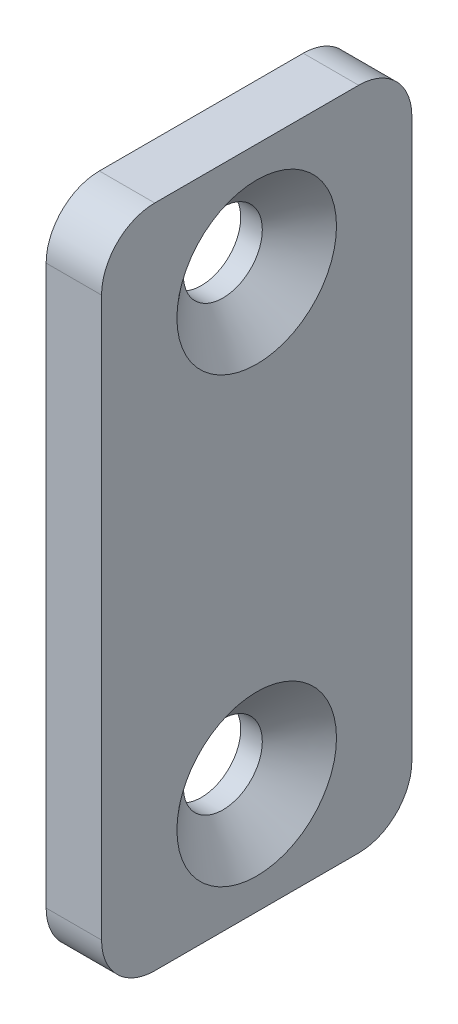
ISO-10303-21;
HEADER;
FILE_DESCRIPTION(('STEP AP214'),'2;1');
FILE_NAME('part.step','',(''),(''),'','','');
FILE_SCHEMA(('AUTOMOTIVE_DESIGN { 1 0 10303 214 1 1 1 1 }'));
ENDSEC;
DATA;
#1=APPLICATION_CONTEXT('core data for automotive mechanical design processes');
#2=APPLICATION_PROTOCOL_DEFINITION('international standard','automotive_design',2000,#1);
#3=PRODUCT_CONTEXT('',#1,'mechanical');
#4=PRODUCT('Part','Part','',(#3));
#5=PRODUCT_RELATED_PRODUCT_CATEGORY('part','',(#4));
#6=PRODUCT_DEFINITION_FORMATION('','',#4);
#7=PRODUCT_DEFINITION_CONTEXT('part definition',#1,'design');
#8=PRODUCT_DEFINITION('design','',#6,#7);
#9=PRODUCT_DEFINITION_SHAPE('','',#8);
#10=(LENGTH_UNIT() NAMED_UNIT(*) SI_UNIT(.MILLI.,.METRE.));
#11=(NAMED_UNIT(*) PLANE_ANGLE_UNIT() SI_UNIT($,.RADIAN.));
#12=(NAMED_UNIT(*) SI_UNIT($,.STERADIAN.) SOLID_ANGLE_UNIT());
#13=UNCERTAINTY_MEASURE_WITH_UNIT(LENGTH_MEASURE(1.E-05),#10,'distance_accuracy_value','');
#14=(GEOMETRIC_REPRESENTATION_CONTEXT(3) GLOBAL_UNCERTAINTY_ASSIGNED_CONTEXT((#13)) GLOBAL_UNIT_ASSIGNED_CONTEXT((#10,
#11,#12)) REPRESENTATION_CONTEXT('',''));
#15=CARTESIAN_POINT('',(0.,0.,0.));
#16=DIRECTION('',(0.,0.,1.));
#17=DIRECTION('',(1.,0.,0.));
#18=AXIS2_PLACEMENT_3D('',#15,#16,#17);
#19=CARTESIAN_POINT('',(1.5875,0.,0.));
#20=DIRECTION('',(1.,0.,0.));
#21=DIRECTION('',(0.,0.,-1.));
#22=AXIS2_PLACEMENT_3D('',#19,#20,#21);
#23=PLANE('',#22);
#24=CARTESIAN_POINT('',(1.587499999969,6.35,0.));
#25=DIRECTION('',(1.,0.,0.));
#26=DIRECTION('',(0.,0.,-1.));
#27=AXIS2_PLACEMENT_3D('',#24,#25,#26);
#28=CIRCLE('',#27,2.28600000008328);
#29=CARTESIAN_POINT('',(1.587499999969,6.35,-2.28600000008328));
#30=VERTEX_POINT('',#29);
#31=EDGE_CURVE('E98',#30,#30,#28,.F.);
#32=ORIENTED_EDGE('',*,*,#31,.T.);
#33=EDGE_LOOP('',(#32));
#34=FACE_BOUND('',#33,.T.);
#35=CARTESIAN_POINT('',(1.58749999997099,-6.35,0.));
#36=DIRECTION('',(1.,0.,0.));
#37=DIRECTION('',(0.,0.,-1.));
#38=AXIS2_PLACEMENT_3D('',#35,#36,#37);
#39=CIRCLE('',#38,2.28600000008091);
#40=CARTESIAN_POINT('',(1.58749999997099,-6.35,-2.28600000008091));
#41=VERTEX_POINT('',#40);
#42=EDGE_CURVE('E20',#41,#41,#39,.F.);
#43=ORIENTED_EDGE('',*,*,#42,.T.);
#44=EDGE_LOOP('',(#43));
#45=FACE_BOUND('',#44,.T.);
#46=DIRECTION('',(0.,1.,0.));
#47=VECTOR('',#46,1.);
#48=CARTESIAN_POINT('',(1.5875,8.001,4.445));
#49=LINE('',#48,#47);
#50=CARTESIAN_POINT('',(1.5875,-8.001,4.445));
#51=VERTEX_POINT('',#50);
#52=CARTESIAN_POINT('',(1.5875,8.001,4.445));
#53=VERTEX_POINT('',#52);
#54=EDGE_CURVE('E94',#51,#53,#49,.T.);
#55=ORIENTED_EDGE('',*,*,#54,.F.);
#56=CARTESIAN_POINT('',(1.5875,-8.001,2.921));
#57=DIRECTION('',(1.,0.,0.));
#58=DIRECTION('',(0.,0.,-1.));
#59=AXIS2_PLACEMENT_3D('',#56,#57,#58);
#60=CIRCLE('',#59,1.524);
#61=CARTESIAN_POINT('',(1.5875,-9.525,2.921));
#62=VERTEX_POINT('',#61);
#63=EDGE_CURVE('E89',#62,#51,#60,.F.);
#64=ORIENTED_EDGE('',*,*,#63,.F.);
#65=DIRECTION('',(0.,0.,-1.));
#66=VECTOR('',#65,1.);
#67=CARTESIAN_POINT('',(1.5875,-9.525,2.921));
#68=LINE('',#67,#66);
#69=CARTESIAN_POINT('',(1.5875,-9.525,-2.921));
#70=VERTEX_POINT('',#69);
#71=EDGE_CURVE('E79',#70,#62,#68,.F.);
#72=ORIENTED_EDGE('',*,*,#71,.F.);
#73=CARTESIAN_POINT('',(1.5875,-8.001,-2.921));
#74=DIRECTION('',(1.,0.,0.));
#75=DIRECTION('',(0.,0.,-1.));
#76=AXIS2_PLACEMENT_3D('',#73,#74,#75);
#77=CIRCLE('',#76,1.524);
#78=CARTESIAN_POINT('',(1.5875,-8.001,-4.445));
#79=VERTEX_POINT('',#78);
#80=EDGE_CURVE('E103',#79,#70,#77,.F.);
#81=ORIENTED_EDGE('',*,*,#80,.F.);
#82=DIRECTION('',(0.,1.,0.));
#83=VECTOR('',#82,1.);
#84=CARTESIAN_POINT('',(1.5875,-8.001,-4.445));
#85=LINE('',#84,#83);
#86=CARTESIAN_POINT('',(1.5875,8.001,-4.445));
#87=VERTEX_POINT('',#86);
#88=EDGE_CURVE('E121',#87,#79,#85,.F.);
#89=ORIENTED_EDGE('',*,*,#88,.F.);
#90=CARTESIAN_POINT('',(1.5875,8.001,-2.921));
#91=DIRECTION('',(1.,0.,0.));
#92=DIRECTION('',(0.,0.,-1.));
#93=AXIS2_PLACEMENT_3D('',#90,#91,#92);
#94=CIRCLE('',#93,1.524);
#95=CARTESIAN_POINT('',(1.5875,9.525,-2.921));
#96=VERTEX_POINT('',#95);
#97=EDGE_CURVE('E143',#96,#87,#94,.F.);
#98=ORIENTED_EDGE('',*,*,#97,.F.);
#99=DIRECTION('',(0.,0.,1.));
#100=VECTOR('',#99,1.);
#101=CARTESIAN_POINT('',(1.5875,9.525,-2.921));
#102=LINE('',#101,#100);
#103=CARTESIAN_POINT('',(1.5875,9.525,2.921));
#104=VERTEX_POINT('',#103);
#105=EDGE_CURVE('E117',#104,#96,#102,.F.);
#106=ORIENTED_EDGE('',*,*,#105,.F.);
#107=CARTESIAN_POINT('',(1.5875,8.001,2.921));
#108=DIRECTION('',(1.,0.,0.));
#109=DIRECTION('',(0.,0.,-1.));
#110=AXIS2_PLACEMENT_3D('',#107,#108,#109);
#111=CIRCLE('',#110,1.524);
#112=EDGE_CURVE('E140',#53,#104,#111,.F.);
#113=ORIENTED_EDGE('',*,*,#112,.F.);
#114=EDGE_LOOP('',(#55,#64,#72,#81,#89,#98,#106,#113));
#115=FACE_BOUND('',#114,.T.);
#116=ADVANCED_FACE('F17',(#34,#45,#115),#23,.T.);
#117=CARTESIAN_POINT('',(1.58749999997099,-6.35,0.));
#118=DIRECTION('',(1.,0.,0.));
#119=DIRECTION('',(0.,0.,-1.));
#120=AXIS2_PLACEMENT_3D('',#117,#118,#119);
#121=CONICAL_SURFACE('',#120,2.28600000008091,0.872664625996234);
#122=CARTESIAN_POINT('',(0.617752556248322,-6.35,0.));
#123=DIRECTION('',(1.,0.,0.));
#124=DIRECTION('',(0.,0.,-1.));
#125=AXIS2_PLACEMENT_3D('',#122,#123,#124);
#126=CIRCLE('',#125,1.1303);
#127=CARTESIAN_POINT('',(0.617752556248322,-6.35,-1.1303));
#128=VERTEX_POINT('',#127);
#129=EDGE_CURVE('E112',#128,#128,#126,.F.);
#130=ORIENTED_EDGE('',*,*,#129,.T.);
#131=EDGE_LOOP('',(#130));
#132=FACE_BOUND('',#131,.T.);
#133=ORIENTED_EDGE('',*,*,#42,.F.);
#134=EDGE_LOOP('',(#133));
#135=FACE_BOUND('',#134,.T.);
#136=ADVANCED_FACE('F151',(#132,#135),#121,.F.);
#137=CARTESIAN_POINT('',(1.58749999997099,6.35,0.));
#138=DIRECTION('',(1.,0.,0.));
#139=DIRECTION('',(0.,0.,-1.));
#140=AXIS2_PLACEMENT_3D('',#137,#138,#139);
#141=CONICAL_SURFACE('',#140,2.28600000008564,0.872664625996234);
#142=CARTESIAN_POINT('',(0.617752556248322,6.35,0.));
#143=DIRECTION('',(-1.,0.,0.));
#144=DIRECTION('',(0.,0.,1.));
#145=AXIS2_PLACEMENT_3D('',#142,#143,#144);
#146=CIRCLE('',#145,1.1303);
#147=CARTESIAN_POINT('',(0.617752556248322,6.35,1.1303));
#148=VERTEX_POINT('',#147);
#149=EDGE_CURVE('E109',#148,#148,#146,.T.);
#150=ORIENTED_EDGE('',*,*,#149,.T.);
#151=EDGE_LOOP('',(#150));
#152=FACE_BOUND('',#151,.T.);
#153=ORIENTED_EDGE('',*,*,#31,.F.);
#154=EDGE_LOOP('',(#153));
#155=FACE_BOUND('',#154,.T.);
#156=ADVANCED_FACE('F153',(#152,#155),#141,.F.);
#157=CARTESIAN_POINT('',(0.,-8.001,2.921));
#158=DIRECTION('',(1.,0.,0.));
#159=DIRECTION('',(0.,0.,-1.));
#160=AXIS2_PLACEMENT_3D('',#157,#158,#159);
#161=CYLINDRICAL_SURFACE('',#160,1.524);
#162=DIRECTION('',(1.,0.,0.));
#163=VECTOR('',#162,1.);
#164=CARTESIAN_POINT('',(0.,-8.001,4.445));
#165=LINE('',#164,#163);
#166=CARTESIAN_POINT('',(0.,-8.001,4.445));
#167=VERTEX_POINT('',#166);
#168=EDGE_CURVE('E116',#167,#51,#165,.T.);
#169=ORIENTED_EDGE('',*,*,#168,.F.);
#170=CARTESIAN_POINT('',(0.,-8.001,2.921));
#171=DIRECTION('',(1.,0.,0.));
#172=DIRECTION('',(0.,0.,-1.));
#173=AXIS2_PLACEMENT_3D('',#170,#171,#172);
#174=CIRCLE('',#173,1.524);
#175=CARTESIAN_POINT('',(0.,-9.525,2.921));
#176=VERTEX_POINT('',#175);
#177=EDGE_CURVE('E102',#167,#176,#174,.T.);
#178=ORIENTED_EDGE('',*,*,#177,.T.);
#179=DIRECTION('',(1.,0.,0.));
#180=VECTOR('',#179,1.);
#181=CARTESIAN_POINT('',(0.,-9.525,2.921));
#182=LINE('',#181,#180);
#183=EDGE_CURVE('E84',#62,#176,#182,.F.);
#184=ORIENTED_EDGE('',*,*,#183,.F.);
#185=ORIENTED_EDGE('',*,*,#63,.T.);
#186=EDGE_LOOP('',(#169,#178,#184,#185));
#187=FACE_BOUND('',#186,.T.);
#188=ADVANCED_FACE('F101',(#187),#161,.T.);
#189=CARTESIAN_POINT('',(0.,-9.525,2.921));
#190=DIRECTION('',(0.,-1.,0.));
#191=DIRECTION('',(0.,0.,-1.));
#192=AXIS2_PLACEMENT_3D('',#189,#190,#191);
#193=PLANE('',#192);
#194=ORIENTED_EDGE('',*,*,#183,.T.);
#195=DIRECTION('',(0.,0.,-1.));
#196=VECTOR('',#195,1.);
#197=CARTESIAN_POINT('',(0.,-9.525,0.));
#198=LINE('',#197,#196);
#199=CARTESIAN_POINT('',(0.,-9.525,-2.921));
#200=VERTEX_POINT('',#199);
#201=EDGE_CURVE('E138',#176,#200,#198,.T.);
#202=ORIENTED_EDGE('',*,*,#201,.T.);
#203=DIRECTION('',(1.,0.,0.));
#204=VECTOR('',#203,1.);
#205=CARTESIAN_POINT('',(0.,-9.525,-2.921));
#206=LINE('',#205,#204);
#207=EDGE_CURVE('E86',#70,#200,#206,.F.);
#208=ORIENTED_EDGE('',*,*,#207,.F.);
#209=ORIENTED_EDGE('',*,*,#71,.T.);
#210=EDGE_LOOP('',(#194,#202,#208,#209));
#211=FACE_BOUND('',#210,.T.);
#212=ADVANCED_FACE('F81',(#211),#193,.T.);
#213=CARTESIAN_POINT('',(0.,-8.001,-2.921));
#214=DIRECTION('',(1.,0.,0.));
#215=DIRECTION('',(0.,0.,-1.));
#216=AXIS2_PLACEMENT_3D('',#213,#214,#215);
#217=CYLINDRICAL_SURFACE('',#216,1.524);
#218=ORIENTED_EDGE('',*,*,#207,.T.);
#219=CARTESIAN_POINT('',(0.,-8.001,-2.921));
#220=DIRECTION('',(1.,0.,0.));
#221=DIRECTION('',(0.,0.,-1.));
#222=AXIS2_PLACEMENT_3D('',#219,#220,#221);
#223=CIRCLE('',#222,1.524);
#224=CARTESIAN_POINT('',(0.,-8.001,-4.445));
#225=VERTEX_POINT('',#224);
#226=EDGE_CURVE('E135',#200,#225,#223,.T.);
#227=ORIENTED_EDGE('',*,*,#226,.T.);
#228=DIRECTION('',(-1.,0.,0.));
#229=VECTOR('',#228,1.);
#230=CARTESIAN_POINT('',(0.,-8.001,-4.445));
#231=LINE('',#230,#229);
#232=EDGE_CURVE('E122',#79,#225,#231,.T.);
#233=ORIENTED_EDGE('',*,*,#232,.F.);
#234=ORIENTED_EDGE('',*,*,#80,.T.);
#235=EDGE_LOOP('',(#218,#227,#233,#234));
#236=FACE_BOUND('',#235,.T.);
#237=ADVANCED_FACE('F197',(#236),#217,.T.);
#238=CARTESIAN_POINT('',(0.,-8.001,-4.445));
#239=DIRECTION('',(0.,0.,-1.));
#240=DIRECTION('',(-1.,0.,0.));
#241=AXIS2_PLACEMENT_3D('',#238,#239,#240);
#242=PLANE('',#241);
#243=ORIENTED_EDGE('',*,*,#232,.T.);
#244=DIRECTION('',(0.,1.,0.));
#245=VECTOR('',#244,1.);
#246=CARTESIAN_POINT('',(0.,0.,-4.445));
#247=LINE('',#246,#245);
#248=CARTESIAN_POINT('',(0.,8.001,-4.445));
#249=VERTEX_POINT('',#248);
#250=EDGE_CURVE('E134',#225,#249,#247,.T.);
#251=ORIENTED_EDGE('',*,*,#250,.T.);
#252=DIRECTION('',(1.,0.,0.));
#253=VECTOR('',#252,1.);
#254=CARTESIAN_POINT('',(0.,8.001,-4.445));
#255=LINE('',#254,#253);
#256=EDGE_CURVE('E120',#87,#249,#255,.F.);
#257=ORIENTED_EDGE('',*,*,#256,.F.);
#258=ORIENTED_EDGE('',*,*,#88,.T.);
#259=EDGE_LOOP('',(#243,#251,#257,#258));
#260=FACE_BOUND('',#259,.T.);
#261=ADVANCED_FACE('F193',(#260),#242,.T.);
#262=CARTESIAN_POINT('',(0.,8.001,-2.921));
#263=DIRECTION('',(1.,0.,0.));
#264=DIRECTION('',(0.,0.,-1.));
#265=AXIS2_PLACEMENT_3D('',#262,#263,#264);
#266=CYLINDRICAL_SURFACE('',#265,1.524);
#267=ORIENTED_EDGE('',*,*,#256,.T.);
#268=CARTESIAN_POINT('',(0.,8.001,-2.921));
#269=DIRECTION('',(1.,0.,0.));
#270=DIRECTION('',(0.,0.,-1.));
#271=AXIS2_PLACEMENT_3D('',#268,#269,#270);
#272=CIRCLE('',#271,1.524);
#273=CARTESIAN_POINT('',(0.,9.525,-2.921));
#274=VERTEX_POINT('',#273);
#275=EDGE_CURVE('E131',#249,#274,#272,.T.);
#276=ORIENTED_EDGE('',*,*,#275,.T.);
#277=DIRECTION('',(1.,0.,0.));
#278=VECTOR('',#277,1.);
#279=CARTESIAN_POINT('',(0.,9.525,-2.921));
#280=LINE('',#279,#278);
#281=EDGE_CURVE('E119',#96,#274,#280,.F.);
#282=ORIENTED_EDGE('',*,*,#281,.F.);
#283=ORIENTED_EDGE('',*,*,#97,.T.);
#284=EDGE_LOOP('',(#267,#276,#282,#283));
#285=FACE_BOUND('',#284,.T.);
#286=ADVANCED_FACE('F189',(#285),#266,.T.);
#287=CARTESIAN_POINT('',(0.,9.525,-2.921));
#288=DIRECTION('',(0.,1.,0.));
#289=DIRECTION('',(0.,0.,1.));
#290=AXIS2_PLACEMENT_3D('',#287,#288,#289);
#291=PLANE('',#290);
#292=ORIENTED_EDGE('',*,*,#281,.T.);
#293=DIRECTION('',(0.,0.,-1.));
#294=VECTOR('',#293,1.);
#295=CARTESIAN_POINT('',(0.,9.525,0.));
#296=LINE('',#295,#294);
#297=CARTESIAN_POINT('',(0.,9.525,2.921));
#298=VERTEX_POINT('',#297);
#299=EDGE_CURVE('E130',#274,#298,#296,.F.);
#300=ORIENTED_EDGE('',*,*,#299,.T.);
#301=DIRECTION('',(1.,0.,0.));
#302=VECTOR('',#301,1.);
#303=CARTESIAN_POINT('',(0.,9.525,2.921));
#304=LINE('',#303,#302);
#305=EDGE_CURVE('E142',#104,#298,#304,.F.);
#306=ORIENTED_EDGE('',*,*,#305,.F.);
#307=ORIENTED_EDGE('',*,*,#105,.T.);
#308=EDGE_LOOP('',(#292,#300,#306,#307));
#309=FACE_BOUND('',#308,.T.);
#310=ADVANCED_FACE('F185',(#309),#291,.T.);
#311=CARTESIAN_POINT('',(0.,8.001,2.921));
#312=DIRECTION('',(1.,0.,0.));
#313=DIRECTION('',(0.,0.,-1.));
#314=AXIS2_PLACEMENT_3D('',#311,#312,#313);
#315=CYLINDRICAL_SURFACE('',#314,1.524);
#316=ORIENTED_EDGE('',*,*,#305,.T.);
#317=CARTESIAN_POINT('',(0.,8.001,2.921));
#318=DIRECTION('',(1.,0.,0.));
#319=DIRECTION('',(0.,0.,-1.));
#320=AXIS2_PLACEMENT_3D('',#317,#318,#319);
#321=CIRCLE('',#320,1.524);
#322=CARTESIAN_POINT('',(0.,8.001,4.445));
#323=VERTEX_POINT('',#322);
#324=EDGE_CURVE('E127',#298,#323,#321,.T.);
#325=ORIENTED_EDGE('',*,*,#324,.T.);
#326=DIRECTION('',(1.,0.,0.));
#327=VECTOR('',#326,1.);
#328=CARTESIAN_POINT('',(0.,8.001,4.445));
#329=LINE('',#328,#327);
#330=EDGE_CURVE('E35',#53,#323,#329,.F.);
#331=ORIENTED_EDGE('',*,*,#330,.F.);
#332=ORIENTED_EDGE('',*,*,#112,.T.);
#333=EDGE_LOOP('',(#316,#325,#331,#332));
#334=FACE_BOUND('',#333,.T.);
#335=ADVANCED_FACE('F182',(#334),#315,.T.);
#336=CARTESIAN_POINT('',(0.,8.001,4.445));
#337=DIRECTION('',(0.,0.,1.));
#338=DIRECTION('',(1.,0.,0.));
#339=AXIS2_PLACEMENT_3D('',#336,#337,#338);
#340=PLANE('',#339);
#341=ORIENTED_EDGE('',*,*,#330,.T.);
#342=DIRECTION('',(0.,1.,0.));
#343=VECTOR('',#342,1.);
#344=CARTESIAN_POINT('',(0.,0.,4.445));
#345=LINE('',#344,#343);
#346=EDGE_CURVE('E126',#323,#167,#345,.F.);
#347=ORIENTED_EDGE('',*,*,#346,.T.);
#348=ORIENTED_EDGE('',*,*,#168,.T.);
#349=ORIENTED_EDGE('',*,*,#54,.T.);
#350=EDGE_LOOP('',(#341,#347,#348,#349));
#351=FACE_BOUND('',#350,.T.);
#352=ADVANCED_FACE('F178',(#351),#340,.T.);
#353=CARTESIAN_POINT('',(-0.2460625,-6.35,0.));
#354=DIRECTION('',(1.,0.,0.));
#355=DIRECTION('',(0.,0.,-1.));
#356=AXIS2_PLACEMENT_3D('',#353,#354,#355);
#357=CYLINDRICAL_SURFACE('',#356,1.1303);
#358=ORIENTED_EDGE('',*,*,#129,.F.);
#359=EDGE_LOOP('',(#358));
#360=FACE_BOUND('',#359,.T.);
#361=CARTESIAN_POINT('',(0.,-6.35,0.));
#362=DIRECTION('',(1.,0.,0.));
#363=DIRECTION('',(0.,0.,-1.));
#364=AXIS2_PLACEMENT_3D('',#361,#362,#363);
#365=CIRCLE('',#364,1.1303);
#366=CARTESIAN_POINT('',(0.,-6.35,-1.1303));
#367=VERTEX_POINT('',#366);
#368=EDGE_CURVE('E26',#367,#367,#365,.F.);
#369=ORIENTED_EDGE('',*,*,#368,.T.);
#370=EDGE_LOOP('',(#369));
#371=FACE_BOUND('',#370,.T.);
#372=ADVANCED_FACE('F170',(#360,#371),#357,.F.);
#373=CARTESIAN_POINT('',(-0.2460625,6.35,0.));
#374=DIRECTION('',(-1.,0.,0.));
#375=DIRECTION('',(0.,0.,1.));
#376=AXIS2_PLACEMENT_3D('',#373,#374,#375);
#377=CYLINDRICAL_SURFACE('',#376,1.1303);
#378=CARTESIAN_POINT('',(0.,6.35,0.));
#379=DIRECTION('',(-1.,0.,0.));
#380=DIRECTION('',(0.,0.,1.));
#381=AXIS2_PLACEMENT_3D('',#378,#379,#380);
#382=CIRCLE('',#381,1.1303);
#383=CARTESIAN_POINT('',(0.,6.35,1.1303));
#384=VERTEX_POINT('',#383);
#385=EDGE_CURVE('E11',#384,#384,#382,.T.);
#386=ORIENTED_EDGE('',*,*,#385,.T.);
#387=EDGE_LOOP('',(#386));
#388=FACE_BOUND('',#387,.T.);
#389=ORIENTED_EDGE('',*,*,#149,.F.);
#390=EDGE_LOOP('',(#389));
#391=FACE_BOUND('',#390,.T.);
#392=ADVANCED_FACE('F164',(#388,#391),#377,.F.);
#393=CARTESIAN_POINT('',(0.,0.,0.));
#394=DIRECTION('',(1.,0.,0.));
#395=DIRECTION('',(0.,0.,-1.));
#396=AXIS2_PLACEMENT_3D('',#393,#394,#395);
#397=PLANE('',#396);
#398=ORIENTED_EDGE('',*,*,#385,.F.);
#399=EDGE_LOOP('',(#398));
#400=FACE_BOUND('',#399,.T.);
#401=ORIENTED_EDGE('',*,*,#368,.F.);
#402=EDGE_LOOP('',(#401));
#403=FACE_BOUND('',#402,.T.);
#404=ORIENTED_EDGE('',*,*,#324,.F.);
#405=ORIENTED_EDGE('',*,*,#299,.F.);
#406=ORIENTED_EDGE('',*,*,#275,.F.);
#407=ORIENTED_EDGE('',*,*,#250,.F.);
#408=ORIENTED_EDGE('',*,*,#226,.F.);
#409=ORIENTED_EDGE('',*,*,#201,.F.);
#410=ORIENTED_EDGE('',*,*,#177,.F.);
#411=ORIENTED_EDGE('',*,*,#346,.F.);
#412=EDGE_LOOP('',(#404,#405,#406,#407,#408,#409,#410,#411));
#413=FACE_BOUND('',#412,.T.);
#414=ADVANCED_FACE('F162',(#400,#403,#413),#397,.F.);
#415=CLOSED_SHELL('',(#116,#136,#156,#188,#212,#237,#261,#286,#310,#335,#352,#372,#392,#414));
#416=MANIFOLD_SOLID_BREP('B1',#415);
#417=ADVANCED_BREP_SHAPE_REPRESENTATION('',(#18,#416),#14);
#418=SHAPE_DEFINITION_REPRESENTATION(#9,#417);
ENDSEC;
END-ISO-10303-21;
